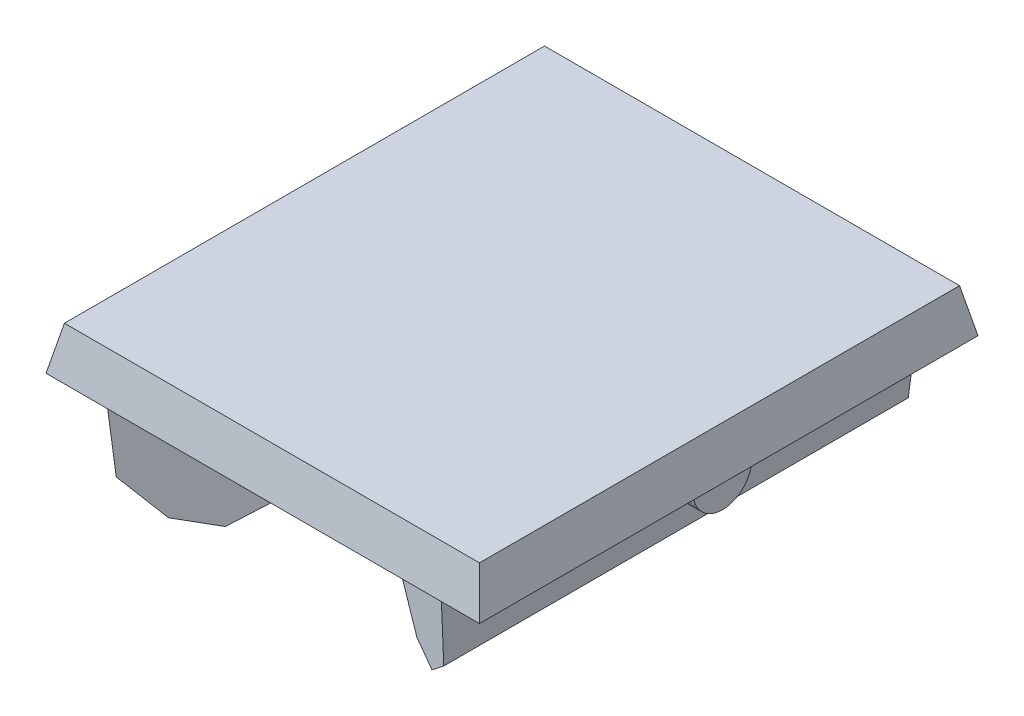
ISO-10303-21;
HEADER;
FILE_DESCRIPTION(('STEP AP214'),'2;1');
FILE_NAME('part.step','',(''),(''),'','','');
FILE_SCHEMA(('AUTOMOTIVE_DESIGN { 1 0 10303 214 1 1 1 1 }'));
ENDSEC;
DATA;
#1=APPLICATION_CONTEXT('core data for automotive mechanical design processes');
#2=APPLICATION_PROTOCOL_DEFINITION('international standard','automotive_design',2000,#1);
#3=PRODUCT_CONTEXT('',#1,'mechanical');
#4=PRODUCT('Part','Part','',(#3));
#5=PRODUCT_RELATED_PRODUCT_CATEGORY('part','',(#4));
#6=PRODUCT_DEFINITION_FORMATION('','',#4);
#7=PRODUCT_DEFINITION_CONTEXT('part definition',#1,'design');
#8=PRODUCT_DEFINITION('design','',#6,#7);
#9=PRODUCT_DEFINITION_SHAPE('','',#8);
#10=(LENGTH_UNIT() NAMED_UNIT(*) SI_UNIT(.MILLI.,.METRE.));
#11=(NAMED_UNIT(*) PLANE_ANGLE_UNIT() SI_UNIT($,.RADIAN.));
#12=(NAMED_UNIT(*) SI_UNIT($,.STERADIAN.) SOLID_ANGLE_UNIT());
#13=UNCERTAINTY_MEASURE_WITH_UNIT(LENGTH_MEASURE(1.E-05),#10,'distance_accuracy_value','');
#14=(GEOMETRIC_REPRESENTATION_CONTEXT(3) GLOBAL_UNCERTAINTY_ASSIGNED_CONTEXT((#13)) GLOBAL_UNIT_ASSIGNED_CONTEXT((#10,
#11,#12)) REPRESENTATION_CONTEXT('',''));
#15=CARTESIAN_POINT('',(0.,0.,0.));
#16=DIRECTION('',(0.,0.,1.));
#17=DIRECTION('',(1.,0.,0.));
#18=AXIS2_PLACEMENT_3D('',#15,#16,#17);
#19=CARTESIAN_POINT('',(-24.8812672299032,-1.30397196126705,110.1));
#20=DIRECTION('',(-0.998629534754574,-0.0523359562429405,0.));
#21=DIRECTION('',(0.0523359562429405,-0.998629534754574,0.));
#22=AXIS2_PLACEMENT_3D('',#19,#20,#21);
#23=PLANE('',#22);
#24=CARTESIAN_POINT('',(-24.7839905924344,-3.16012077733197,0.0591410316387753));
#25=DIRECTION('',(-0.998629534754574,-0.0523359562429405,0.));
#26=DIRECTION('',(-0.0523359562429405,0.998629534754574,0.));
#27=AXIS2_PLACEMENT_3D('',#24,#25,#26);
#28=ELLIPSE('',#27,13.5029463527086,13.4844410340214);
#29=CARTESIAN_POINT('',(-24.7839905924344,-3.16012077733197,-13.4253000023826));
#30=VERTEX_POINT('',#29);
#31=CARTESIAN_POINT('',(-24.7839905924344,-3.16012077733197,13.5435820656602));
#32=VERTEX_POINT('',#31);
#33=EDGE_CURVE('E12',#30,#32,#28,.T.);
#34=ORIENTED_EDGE('',*,*,#33,.F.);
#35=DIRECTION('',(0.,0.,-1.));
#36=VECTOR('',#35,1.);
#37=CARTESIAN_POINT('',(-24.7839905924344,-3.16012077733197,110.1));
#38=LINE('',#37,#36);
#39=CARTESIAN_POINT('',(-24.7839905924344,-3.16012077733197,-110.1));
#40=VERTEX_POINT('',#39);
#41=EDGE_CURVE('E323',#30,#40,#38,.T.);
#42=ORIENTED_EDGE('',*,*,#41,.T.);
#43=DIRECTION('',(-0.0523359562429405,0.998629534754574,0.));
#44=VECTOR('',#43,1.);
#45=CARTESIAN_POINT('',(-24.8812672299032,-1.30397196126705,-110.1));
#46=LINE('',#45,#44);
#47=CARTESIAN_POINT('',(-24.7088643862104,-4.59361418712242,-110.1));
#48=VERTEX_POINT('',#47);
#49=EDGE_CURVE('E324',#48,#40,#46,.T.);
#50=ORIENTED_EDGE('',*,*,#49,.F.);
#51=DIRECTION('',(0.0521220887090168,-0.994548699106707,0.0903115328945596));
#52=VECTOR('',#51,1.);
#53=CARTESIAN_POINT('',(-23.843329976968,-21.1089945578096,-108.600295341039));
#54=LINE('',#53,#52);
#55=CARTESIAN_POINT('',(-23.0440352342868,-36.3604467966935,-107.21536363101));
#56=VERTEX_POINT('',#55);
#57=EDGE_CURVE('E314',#56,#48,#54,.F.);
#58=ORIENTED_EDGE('',*,*,#57,.F.);
#59=DIRECTION('',(0.,0.,-1.));
#60=VECTOR('',#59,1.);
#61=CARTESIAN_POINT('',(-23.0440352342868,-36.3604467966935,110.1));
#62=LINE('',#61,#60);
#63=CARTESIAN_POINT('',(-23.0440352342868,-36.3604467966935,107.093597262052));
#64=VERTEX_POINT('',#63);
#65=EDGE_CURVE('E344',#64,#56,#62,.T.);
#66=ORIENTED_EDGE('',*,*,#65,.F.);
#67=DIRECTION('',(-0.0521220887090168,0.994548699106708,0.0903115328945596));
#68=VECTOR('',#67,1.);
#69=CARTESIAN_POINT('',(-24.8804342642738,-1.3198658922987,110.275511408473));
#70=LINE('',#69,#68);
#71=CARTESIAN_POINT('',(-24.779140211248,-3.25267156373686,110.1));
#72=VERTEX_POINT('',#71);
#73=EDGE_CURVE('E357',#72,#64,#70,.F.);
#74=ORIENTED_EDGE('',*,*,#73,.F.);
#75=DIRECTION('',(-0.0523359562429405,0.998629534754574,0.));
#76=VECTOR('',#75,1.);
#77=CARTESIAN_POINT('',(-24.8812672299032,-1.30397196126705,110.1));
#78=LINE('',#77,#76);
#79=CARTESIAN_POINT('',(-24.7839905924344,-3.16012077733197,110.1));
#80=VERTEX_POINT('',#79);
#81=EDGE_CURVE('E317',#72,#80,#78,.T.);
#82=ORIENTED_EDGE('',*,*,#81,.T.);
#83=EDGE_CURVE('E330',#80,#32,#38,.T.);
#84=ORIENTED_EDGE('',*,*,#83,.T.);
#85=EDGE_LOOP('',(#34,#42,#50,#58,#66,#74,#82,#84));
#86=FACE_BOUND('',#85,.T.);
#87=ADVANCED_FACE('F57',(#86),#23,.T.);
#88=CARTESIAN_POINT('',(-28.7238682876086,-31.1175239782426,110.1));
#89=DIRECTION('',(-0.678280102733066,-0.734803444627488,0.));
#90=DIRECTION('',(0.734803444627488,-0.678280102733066,0.));
#91=AXIS2_PLACEMENT_3D('',#88,#89,#90);
#92=PLANE('',#91);
#93=DIRECTION('',(-0.66613673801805,0.6148954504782,0.422096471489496));
#94=VECTOR('',#93,1.);
#95=CARTESIAN_POINT('',(-28.5572405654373,-31.2713341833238,110.58703094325));
#96=LINE('',#95,#94);
#97=CARTESIAN_POINT('',(-8.31918008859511,-49.952620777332,97.7632165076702));
#98=VERTEX_POINT('',#97);
#99=EDGE_CURVE('E355',#64,#98,#96,.F.);
#100=ORIENTED_EDGE('',*,*,#99,.F.);
#101=ORIENTED_EDGE('',*,*,#65,.T.);
#102=DIRECTION('',(0.66613673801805,-0.6148954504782,0.422096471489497));
#103=VECTOR('',#102,1.);
#104=CARTESIAN_POINT('',(33.3915044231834,-88.4547910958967,-71.4550747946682));
#105=LINE('',#104,#103);
#106=CARTESIAN_POINT('',(-8.31918008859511,-49.952620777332,-97.8849828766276));
#107=VERTEX_POINT('',#106);
#108=EDGE_CURVE('E371',#107,#56,#105,.F.);
#109=ORIENTED_EDGE('',*,*,#108,.F.);
#110=DIRECTION('',(0.,0.,-1.));
#111=VECTOR('',#110,1.);
#112=CARTESIAN_POINT('',(-8.31918008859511,-49.952620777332,110.1));
#113=LINE('',#112,#111);
#114=EDGE_CURVE('E341',#98,#107,#113,.T.);
#115=ORIENTED_EDGE('',*,*,#114,.F.);
#116=EDGE_LOOP('',(#100,#101,#109,#115));
#117=FACE_BOUND('',#116,.T.);
#118=ADVANCED_FACE('F407',(#117),#92,.T.);
#119=CARTESIAN_POINT('',(0.,-49.952620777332,110.1));
#120=DIRECTION('',(0.,-1.,0.));
#121=DIRECTION('',(0.,0.,-1.));
#122=AXIS2_PLACEMENT_3D('',#119,#120,#121);
#123=PLANE('',#122);
#124=DIRECTION('',(-0.86586507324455,0.,0.500277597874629));
#125=VECTOR('',#124,1.);
#126=CARTESIAN_POINT('',(-7.4260653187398,-49.952620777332,97.2471946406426));
#127=LINE('',#126,#125);
#128=CARTESIAN_POINT('',(8.31918008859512,-49.952620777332,88.1499417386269));
#129=VERTEX_POINT('',#128);
#130=EDGE_CURVE('E353',#98,#129,#127,.F.);
#131=ORIENTED_EDGE('',*,*,#130,.F.);
#132=ORIENTED_EDGE('',*,*,#114,.T.);
#133=DIRECTION('',(0.86586507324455,0.,0.50027759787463));
#134=VECTOR('',#133,1.);
#135=CARTESIAN_POINT('',(88.0113529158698,-49.952620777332,-42.227341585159));
#136=LINE('',#135,#134);
#137=CARTESIAN_POINT('',(8.31918008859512,-49.952620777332,-88.2717081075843));
#138=VERTEX_POINT('',#137);
#139=EDGE_CURVE('E365',#138,#107,#136,.F.);
#140=ORIENTED_EDGE('',*,*,#139,.F.);
#141=DIRECTION('',(0.,0.,-1.));
#142=VECTOR('',#141,1.);
#143=CARTESIAN_POINT('',(8.31918008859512,-49.952620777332,110.1));
#144=LINE('',#143,#142);
#145=EDGE_CURVE('E338',#129,#138,#144,.T.);
#146=ORIENTED_EDGE('',*,*,#145,.F.);
#147=EDGE_LOOP('',(#131,#132,#140,#146));
#148=FACE_BOUND('',#147,.T.);
#149=ADVANCED_FACE('F412',(#148),#123,.T.);
#150=CARTESIAN_POINT('',(28.7238682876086,-31.1175239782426,110.1));
#151=DIRECTION('',(-0.678280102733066,0.734803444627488,0.));
#152=DIRECTION('',(-0.734803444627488,-0.678280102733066,0.));
#153=AXIS2_PLACEMENT_3D('',#150,#151,#152);
#154=PLANE('',#153);
#155=DIRECTION('',(0.,0.,-1.));
#156=VECTOR('',#155,1.);
#157=CARTESIAN_POINT('',(23.0440352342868,-36.3604467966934,110.1));
#158=LINE('',#157,#156);
#159=CARTESIAN_POINT('',(23.0440352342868,-36.3604467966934,80.4649343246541));
#160=VERTEX_POINT('',#159);
#161=CARTESIAN_POINT('',(23.0440352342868,-36.3604467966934,-80.5867006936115));
#162=VERTEX_POINT('',#161);
#163=EDGE_CURVE('E335',#160,#162,#158,.T.);
#164=ORIENTED_EDGE('',*,*,#163,.F.);
#165=DIRECTION('',(0.686081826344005,0.633306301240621,-0.358071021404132));
#166=VECTOR('',#165,1.);
#167=CARTESIAN_POINT('',(20.7153006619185,-38.510047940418,81.680317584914));
#168=LINE('',#167,#166);
#169=EDGE_CURVE('E350',#160,#129,#168,.F.);
#170=ORIENTED_EDGE('',*,*,#169,.T.);
#171=ORIENTED_EDGE('',*,*,#145,.T.);
#172=DIRECTION('',(-0.686081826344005,-0.633306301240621,-0.358071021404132));
#173=VECTOR('',#172,1.);
#174=CARTESIAN_POINT('',(74.8408721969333,11.4520180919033,-53.5535603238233));
#175=LINE('',#174,#173);
#176=EDGE_CURVE('E362',#138,#162,#175,.F.);
#177=ORIENTED_EDGE('',*,*,#176,.T.);
#178=EDGE_LOOP('',(#164,#170,#171,#177));
#179=FACE_BOUND('',#178,.T.);
#180=ADVANCED_FACE('F439',(#179),#154,.F.);
#181=CARTESIAN_POINT('',(24.8812672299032,-1.30397196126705,110.1));
#182=DIRECTION('',(-0.998629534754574,0.0523359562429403,0.));
#183=DIRECTION('',(-0.0523359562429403,-0.998629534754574,0.));
#184=AXIS2_PLACEMENT_3D('',#181,#182,#183);
#185=PLANE('',#184);
#186=DIRECTION('',(0.,0.,-1.));
#187=VECTOR('',#186,1.);
#188=CARTESIAN_POINT('',(24.7839905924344,-3.16012077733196,110.1));
#189=LINE('',#188,#187);
#190=CARTESIAN_POINT('',(24.7839905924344,-3.16012077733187,-14.0427951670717));
#191=VERTEX_POINT('',#190);
#192=CARTESIAN_POINT('',(24.7839905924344,-3.16012077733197,-81.5908925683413));
#193=VERTEX_POINT('',#192);
#194=EDGE_CURVE('E332',#191,#193,#189,.T.);
#195=ORIENTED_EDGE('',*,*,#194,.F.);
#196=CARTESIAN_POINT('',(24.7839905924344,-3.16012077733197,0.0591410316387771));
#197=DIRECTION('',(-0.998629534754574,0.0523359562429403,0.));
#198=DIRECTION('',(-0.0523359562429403,-0.998629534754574,0.));
#199=AXIS2_PLACEMENT_3D('',#196,#197,#198);
#200=ELLIPSE('',#199,14.1212889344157,14.1019361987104);
#201=CARTESIAN_POINT('',(24.7839905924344,-3.16012077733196,14.1610772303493));
#202=VERTEX_POINT('',#201);
#203=EDGE_CURVE('E65',#191,#202,#200,.T.);
#204=ORIENTED_EDGE('',*,*,#203,.T.);
#205=CARTESIAN_POINT('',(24.7839905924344,-3.16012077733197,81.4691261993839));
#206=VERTEX_POINT('',#205);
#207=EDGE_CURVE('E333',#206,#202,#189,.T.);
#208=ORIENTED_EDGE('',*,*,#207,.F.);
#209=DIRECTION('',(0.0523120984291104,0.998174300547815,0.0301912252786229));
#210=VECTOR('',#209,1.);
#211=CARTESIAN_POINT('',(24.9263971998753,-0.442840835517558,81.5513142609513));
#212=LINE('',#211,#210);
#213=EDGE_CURVE('E327',#206,#160,#212,.F.);
#214=ORIENTED_EDGE('',*,*,#213,.T.);
#215=ORIENTED_EDGE('',*,*,#163,.T.);
#216=DIRECTION('',(-0.0523120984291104,-0.998174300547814,0.0301912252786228));
#217=VECTOR('',#216,1.);
#218=CARTESIAN_POINT('',(24.5784284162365,-7.08248075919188,-81.4722551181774));
#219=LINE('',#218,#217);
#220=EDGE_CURVE('E359',#162,#193,#219,.F.);
#221=ORIENTED_EDGE('',*,*,#220,.T.);
#222=EDGE_LOOP('',(#195,#204,#208,#214,#215,#221));
#223=FACE_BOUND('',#222,.T.);
#224=ADVANCED_FACE('F376',(#223),#185,.F.);
#225=CARTESIAN_POINT('',(0.,-3.16012077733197,110.1));
#226=DIRECTION('',(0.,1.,0.));
#227=DIRECTION('',(0.,0.,1.));
#228=AXIS2_PLACEMENT_3D('',#225,#226,#227);
#229=PLANE('',#228);
#230=ORIENTED_EDGE('',*,*,#207,.T.);
#231=DIRECTION('',(1.,0.,0.));
#232=VECTOR('',#231,1.);
#233=CARTESIAN_POINT('',(23.635525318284,-3.16012077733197,14.1610772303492));
#234=LINE('',#233,#232);
#235=CARTESIAN_POINT('',(80.2160094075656,-3.16012077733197,14.1610772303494));
#236=VERTEX_POINT('',#235);
#237=EDGE_CURVE('E78',#202,#236,#234,.T.);
#238=ORIENTED_EDGE('',*,*,#237,.T.);
#239=DIRECTION('',(0.,0.,-1.));
#240=VECTOR('',#239,1.);
#241=CARTESIAN_POINT('',(80.2160094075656,-3.16012077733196,110.1));
#242=LINE('',#241,#240);
#243=CARTESIAN_POINT('',(80.2160094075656,-3.16012077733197,81.4691261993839));
#244=VERTEX_POINT('',#243);
#245=EDGE_CURVE('E245',#244,#236,#242,.T.);
#246=ORIENTED_EDGE('',*,*,#245,.F.);
#247=DIRECTION('',(0.86586507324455,0.,0.500277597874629));
#248=VECTOR('',#247,1.);
#249=CARTESIAN_POINT('',(136.166791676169,-3.16012077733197,113.796244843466));
#250=LINE('',#249,#248);
#251=CARTESIAN_POINT('',(129.769444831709,-3.16012077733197,110.1));
#252=VERTEX_POINT('',#251);
#253=EDGE_CURVE('E225',#244,#252,#250,.T.);
#254=ORIENTED_EDGE('',*,*,#253,.T.);
#255=DIRECTION('',(-1.,0.,0.));
#256=VECTOR('',#255,1.);
#257=CARTESIAN_POINT('',(105.,-3.16012077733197,110.1));
#258=LINE('',#257,#256);
#259=CARTESIAN_POINT('',(129.783990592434,-3.16012077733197,110.1));
#260=VERTEX_POINT('',#259);
#261=EDGE_CURVE('E235',#260,#252,#258,.T.);
#262=ORIENTED_EDGE('',*,*,#261,.F.);
#263=DIRECTION('',(0.,0.,-1.));
#264=VECTOR('',#263,1.);
#265=CARTESIAN_POINT('',(129.783990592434,-3.16012077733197,110.1));
#266=LINE('',#265,#264);
#267=CARTESIAN_POINT('',(129.783990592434,-3.16012077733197,13.5435820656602));
#268=VERTEX_POINT('',#267);
#269=EDGE_CURVE('E241',#260,#268,#266,.T.);
#270=ORIENTED_EDGE('',*,*,#269,.T.);
#271=DIRECTION('',(-1.,0.,0.));
#272=VECTOR('',#271,1.);
#273=CARTESIAN_POINT('',(129.628570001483,-3.16012077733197,13.5435820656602));
#274=LINE('',#273,#272);
#275=CARTESIAN_POINT('',(149.628570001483,-3.16012077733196,13.5435820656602));
#276=VERTEX_POINT('',#275);
#277=EDGE_CURVE('E289',#276,#268,#274,.T.);
#278=ORIENTED_EDGE('',*,*,#277,.F.);
#279=DIRECTION('',(0.,0.,1.));
#280=VECTOR('',#279,1.);
#281=CARTESIAN_POINT('',(149.628570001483,-3.16012077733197,-13.4253000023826));
#282=LINE('',#281,#280);
#283=CARTESIAN_POINT('',(149.628570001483,-3.16012077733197,-13.4253000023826));
#284=VERTEX_POINT('',#283);
#285=EDGE_CURVE('E286',#284,#276,#282,.T.);
#286=ORIENTED_EDGE('',*,*,#285,.F.);
#287=DIRECTION('',(-1.,0.,0.));
#288=VECTOR('',#287,1.);
#289=CARTESIAN_POINT('',(129.628570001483,-3.16012077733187,-13.4253000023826));
#290=LINE('',#289,#288);
#291=CARTESIAN_POINT('',(129.783990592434,-3.16012077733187,-13.4253000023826));
#292=VERTEX_POINT('',#291);
#293=EDGE_CURVE('E291',#284,#292,#290,.T.);
#294=ORIENTED_EDGE('',*,*,#293,.T.);
#295=CARTESIAN_POINT('',(129.783990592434,-3.16012077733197,-110.1));
#296=VERTEX_POINT('',#295);
#297=EDGE_CURVE('E231',#292,#296,#266,.T.);
#298=ORIENTED_EDGE('',*,*,#297,.T.);
#299=DIRECTION('',(-1.,0.,0.));
#300=VECTOR('',#299,1.);
#301=CARTESIAN_POINT('',(105.,-3.16012077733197,-110.1));
#302=LINE('',#301,#300);
#303=CARTESIAN_POINT('',(129.558695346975,-3.16012077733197,-110.1));
#304=VERTEX_POINT('',#303);
#305=EDGE_CURVE('E208',#296,#304,#302,.T.);
#306=ORIENTED_EDGE('',*,*,#305,.T.);
#307=DIRECTION('',(-0.86586507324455,0.,0.50027759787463));
#308=VECTOR('',#307,1.);
#309=CARTESIAN_POINT('',(135.958082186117,-3.16012077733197,-113.79742350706));
#310=LINE('',#309,#308);
#311=CARTESIAN_POINT('',(80.2160094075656,-3.16012077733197,-81.5908925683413));
#312=VERTEX_POINT('',#311);
#313=EDGE_CURVE('E219',#304,#312,#310,.T.);
#314=ORIENTED_EDGE('',*,*,#313,.T.);
#315=CARTESIAN_POINT('',(80.2160094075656,-3.16012077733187,-14.0427951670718));
#316=VERTEX_POINT('',#315);
#317=EDGE_CURVE('E244',#316,#312,#242,.T.);
#318=ORIENTED_EDGE('',*,*,#317,.F.);
#319=DIRECTION('',(1.,0.,0.));
#320=VECTOR('',#319,1.);
#321=CARTESIAN_POINT('',(23.635525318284,-3.16012077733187,-14.0427951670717));
#322=LINE('',#321,#320);
#323=EDGE_CURVE('E299',#191,#316,#322,.T.);
#324=ORIENTED_EDGE('',*,*,#323,.F.);
#325=ORIENTED_EDGE('',*,*,#194,.T.);
#326=DIRECTION('',(0.86586507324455,0.,0.50027759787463));
#327=VECTOR('',#326,1.);
#328=CARTESIAN_POINT('',(-30.9580821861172,-3.16012077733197,-113.79742350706));
#329=LINE('',#328,#327);
#330=CARTESIAN_POINT('',(-24.5586953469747,-3.16012077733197,-110.1));
#331=VERTEX_POINT('',#330);
#332=EDGE_CURVE('E311',#331,#193,#329,.T.);
#333=ORIENTED_EDGE('',*,*,#332,.F.);
#334=DIRECTION('',(1.,0.,0.));
#335=VECTOR('',#334,1.);
#336=CARTESIAN_POINT('',(0.,-3.16012077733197,-110.1));
#337=LINE('',#336,#335);
#338=EDGE_CURVE('E320',#40,#331,#337,.T.);
#339=ORIENTED_EDGE('',*,*,#338,.F.);
#340=ORIENTED_EDGE('',*,*,#41,.F.);
#341=DIRECTION('',(1.,0.,0.));
#342=VECTOR('',#341,1.);
#343=CARTESIAN_POINT('',(-24.6285700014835,-3.16012077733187,-13.4253000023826));
#344=LINE('',#343,#342);
#345=CARTESIAN_POINT('',(-44.6285700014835,-3.16012077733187,-13.4253000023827));
#346=VERTEX_POINT('',#345);
#347=EDGE_CURVE('E301',#346,#30,#344,.T.);
#348=ORIENTED_EDGE('',*,*,#347,.F.);
#349=DIRECTION('',(0.,0.,-1.));
#350=VECTOR('',#349,1.);
#351=CARTESIAN_POINT('',(-44.6285700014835,-3.16012077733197,0.059141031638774));
#352=LINE('',#351,#350);
#353=CARTESIAN_POINT('',(-44.6285700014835,-3.16012077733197,13.5435820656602));
#354=VERTEX_POINT('',#353);
#355=EDGE_CURVE('E296',#354,#346,#352,.T.);
#356=ORIENTED_EDGE('',*,*,#355,.F.);
#357=DIRECTION('',(1.,0.,0.));
#358=VECTOR('',#357,1.);
#359=CARTESIAN_POINT('',(-24.6285700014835,-3.16012077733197,13.5435820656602));
#360=LINE('',#359,#358);
#361=EDGE_CURVE('E295',#354,#32,#360,.T.);
#362=ORIENTED_EDGE('',*,*,#361,.T.);
#363=ORIENTED_EDGE('',*,*,#83,.F.);
#364=DIRECTION('',(1.,0.,0.));
#365=VECTOR('',#364,1.);
#366=CARTESIAN_POINT('',(0.,-3.16012077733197,110.1));
#367=LINE('',#366,#365);
#368=CARTESIAN_POINT('',(-24.7694448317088,-3.16012077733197,110.1));
#369=VERTEX_POINT('',#368);
#370=EDGE_CURVE('E319',#80,#369,#367,.T.);
#371=ORIENTED_EDGE('',*,*,#370,.T.);
#372=DIRECTION('',(-0.86586507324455,0.,0.500277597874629));
#373=VECTOR('',#372,1.);
#374=CARTESIAN_POINT('',(-31.1667916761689,-3.16012077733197,113.796244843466));
#375=LINE('',#374,#373);
#376=EDGE_CURVE('E312',#206,#369,#375,.T.);
#377=ORIENTED_EDGE('',*,*,#376,.F.);
#378=EDGE_LOOP('',(#230,#238,#246,#254,#262,#270,#278,#286,#294,#298,#306,#314,#318,#324,#325,
#333,#339,#340,#348,#356,#362,#363,#371,#377));
#379=FACE_BOUND('',#378,.T.);
#380=ADVANCED_FACE('F228',(#379),#229,.T.);
#381=CARTESIAN_POINT('',(0.,0.,110.1));
#382=DIRECTION('',(0.,0.,1.));
#383=DIRECTION('',(1.,0.,0.));
#384=AXIS2_PLACEMENT_3D('',#381,#382,#383);
#385=PLANE('',#384);
#386=DIRECTION('',(0.104187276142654,0.994557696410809,0.));
#387=VECTOR('',#386,1.);
#388=CARTESIAN_POINT('',(-24.1731202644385,2.53231317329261,110.1));
#389=LINE('',#388,#387);
#390=EDGE_CURVE('E360',#369,#72,#389,.F.);
#391=ORIENTED_EDGE('',*,*,#390,.F.);
#392=ORIENTED_EDGE('',*,*,#370,.F.);
#393=ORIENTED_EDGE('',*,*,#81,.F.);
#394=EDGE_LOOP('',(#391,#392,#393));
#395=FACE_BOUND('',#394,.T.);
#396=ADVANCED_FACE('F388',(#395),#385,.T.);
#397=CARTESIAN_POINT('',(0.,0.,-110.1));
#398=DIRECTION('',(0.,0.,1.));
#399=DIRECTION('',(1.,0.,0.));
#400=AXIS2_PLACEMENT_3D('',#397,#398,#399);
#401=PLANE('',#400);
#402=ORIENTED_EDGE('',*,*,#338,.T.);
#403=DIRECTION('',(0.104187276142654,0.994557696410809,0.));
#404=VECTOR('',#403,1.);
#405=CARTESIAN_POINT('',(-23.9646584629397,2.51047525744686,-110.1));
#406=LINE('',#405,#404);
#407=EDGE_CURVE('E347',#331,#48,#406,.F.);
#408=ORIENTED_EDGE('',*,*,#407,.T.);
#409=ORIENTED_EDGE('',*,*,#49,.T.);
#410=EDGE_LOOP('',(#402,#408,#409));
#411=FACE_BOUND('',#410,.T.);
#412=ADVANCED_FACE('F424',(#411),#401,.F.);
#413=CARTESIAN_POINT('',(-30.9580821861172,-3.16012077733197,-113.79742350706));
#414=DIRECTION('',(0.499591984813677,-0.0523359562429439,-0.86467843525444));
#415=DIRECTION('',(-0.86586507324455,0.,-0.50027759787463));
#416=AXIS2_PLACEMENT_3D('',#413,#414,#415);
#417=PLANE('',#416);
#418=ORIENTED_EDGE('',*,*,#176,.F.);
#419=ORIENTED_EDGE('',*,*,#139,.T.);
#420=ORIENTED_EDGE('',*,*,#108,.T.);
#421=ORIENTED_EDGE('',*,*,#57,.T.);
#422=ORIENTED_EDGE('',*,*,#407,.F.);
#423=ORIENTED_EDGE('',*,*,#332,.T.);
#424=ORIENTED_EDGE('',*,*,#220,.F.);
#425=EDGE_LOOP('',(#418,#419,#420,#421,#422,#423,#424));
#426=FACE_BOUND('',#425,.T.);
#427=ADVANCED_FACE('F59',(#426),#417,.T.);
#428=CARTESIAN_POINT('',(-31.1667916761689,-3.16012077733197,113.796244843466));
#429=DIRECTION('',(0.499591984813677,-0.0523359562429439,0.86467843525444));
#430=DIRECTION('',(0.86586507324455,0.,-0.500277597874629));
#431=AXIS2_PLACEMENT_3D('',#428,#429,#430);
#432=PLANE('',#431);
#433=ORIENTED_EDGE('',*,*,#376,.T.);
#434=ORIENTED_EDGE('',*,*,#390,.T.);
#435=ORIENTED_EDGE('',*,*,#73,.T.);
#436=ORIENTED_EDGE('',*,*,#99,.T.);
#437=ORIENTED_EDGE('',*,*,#130,.T.);
#438=ORIENTED_EDGE('',*,*,#169,.F.);
#439=ORIENTED_EDGE('',*,*,#213,.F.);
#440=EDGE_LOOP('',(#433,#434,#435,#436,#437,#438,#439));
#441=FACE_BOUND('',#440,.T.);
#442=ADVANCED_FACE('F384',(#441),#432,.T.);
#443=CARTESIAN_POINT('',(136.166791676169,-3.16012077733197,113.796244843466));
#444=DIRECTION('',(-0.499591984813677,-0.0523359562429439,0.86467843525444));
#445=DIRECTION('',(-0.86586507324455,0.,-0.500277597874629));
#446=AXIS2_PLACEMENT_3D('',#443,#444,#445);
#447=PLANE('',#446);
#448=ORIENTED_EDGE('',*,*,#253,.F.);
#449=DIRECTION('',(-0.0523120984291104,0.998174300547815,0.0301912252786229));
#450=VECTOR('',#449,1.);
#451=CARTESIAN_POINT('',(80.0736028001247,-0.442840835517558,81.5513142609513));
#452=LINE('',#451,#450);
#453=CARTESIAN_POINT('',(81.9559647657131,-36.3604467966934,80.4649343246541));
#454=VERTEX_POINT('',#453);
#455=EDGE_CURVE('E237',#244,#454,#452,.F.);
#456=ORIENTED_EDGE('',*,*,#455,.T.);
#457=DIRECTION('',(-0.686081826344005,0.633306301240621,-0.358071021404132));
#458=VECTOR('',#457,1.);
#459=CARTESIAN_POINT('',(84.2846993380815,-38.510047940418,81.680317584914));
#460=LINE('',#459,#458);
#461=CARTESIAN_POINT('',(96.6808199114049,-49.952620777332,88.1499417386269));
#462=VERTEX_POINT('',#461);
#463=EDGE_CURVE('E260',#454,#462,#460,.F.);
#464=ORIENTED_EDGE('',*,*,#463,.T.);
#465=DIRECTION('',(0.86586507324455,0.,0.500277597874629));
#466=VECTOR('',#465,1.);
#467=CARTESIAN_POINT('',(112.42606531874,-49.952620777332,97.2471946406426));
#468=LINE('',#467,#466);
#469=CARTESIAN_POINT('',(113.319180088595,-49.952620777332,97.7632165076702));
#470=VERTEX_POINT('',#469);
#471=EDGE_CURVE('E262',#470,#462,#468,.F.);
#472=ORIENTED_EDGE('',*,*,#471,.F.);
#473=DIRECTION('',(0.66613673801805,0.6148954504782,0.422096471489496));
#474=VECTOR('',#473,1.);
#475=CARTESIAN_POINT('',(133.557240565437,-31.2713341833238,110.58703094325));
#476=LINE('',#475,#474);
#477=CARTESIAN_POINT('',(128.044035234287,-36.3604467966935,107.093597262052));
#478=VERTEX_POINT('',#477);
#479=EDGE_CURVE('E265',#478,#470,#476,.F.);
#480=ORIENTED_EDGE('',*,*,#479,.F.);
#481=DIRECTION('',(0.0521220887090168,0.994548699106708,0.0903115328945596));
#482=VECTOR('',#481,1.);
#483=CARTESIAN_POINT('',(129.880434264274,-1.3198658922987,110.275511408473));
#484=LINE('',#483,#482);
#485=CARTESIAN_POINT('',(129.779140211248,-3.25267156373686,110.1));
#486=VERTEX_POINT('',#485);
#487=EDGE_CURVE('E268',#486,#478,#484,.F.);
#488=ORIENTED_EDGE('',*,*,#487,.F.);
#489=DIRECTION('',(-0.104187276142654,0.994557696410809,0.));
#490=VECTOR('',#489,1.);
#491=CARTESIAN_POINT('',(129.173120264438,2.53231317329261,110.1));
#492=LINE('',#491,#490);
#493=EDGE_CURVE('E214',#252,#486,#492,.F.);
#494=ORIENTED_EDGE('',*,*,#493,.F.);
#495=EDGE_LOOP('',(#448,#456,#464,#472,#480,#488,#494));
#496=FACE_BOUND('',#495,.T.);
#497=ADVANCED_FACE('F417',(#496),#447,.T.);
#498=CARTESIAN_POINT('',(135.958082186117,-3.16012077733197,-113.79742350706));
#499=DIRECTION('',(-0.499591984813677,-0.0523359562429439,-0.86467843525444));
#500=DIRECTION('',(0.86586507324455,0.,-0.50027759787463));
#501=AXIS2_PLACEMENT_3D('',#498,#499,#500);
#502=PLANE('',#501);
#503=DIRECTION('',(0.686081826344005,-0.633306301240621,-0.358071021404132));
#504=VECTOR('',#503,1.);
#505=CARTESIAN_POINT('',(30.1591278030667,11.4520180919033,-53.5535603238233));
#506=LINE('',#505,#504);
#507=CARTESIAN_POINT('',(96.6808199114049,-49.952620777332,-88.2717081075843));
#508=VERTEX_POINT('',#507);
#509=CARTESIAN_POINT('',(81.9559647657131,-36.3604467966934,-80.5867006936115));
#510=VERTEX_POINT('',#509);
#511=EDGE_CURVE('E273',#508,#510,#506,.F.);
#512=ORIENTED_EDGE('',*,*,#511,.T.);
#513=DIRECTION('',(0.0523120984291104,-0.998174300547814,0.0301912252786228));
#514=VECTOR('',#513,1.);
#515=CARTESIAN_POINT('',(80.4215715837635,-7.08248075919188,-81.4722551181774));
#516=LINE('',#515,#514);
#517=EDGE_CURVE('E222',#510,#312,#516,.F.);
#518=ORIENTED_EDGE('',*,*,#517,.T.);
#519=ORIENTED_EDGE('',*,*,#313,.F.);
#520=DIRECTION('',(-0.104187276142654,0.994557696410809,0.));
#521=VECTOR('',#520,1.);
#522=CARTESIAN_POINT('',(128.96465846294,2.51047525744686,-110.1));
#523=LINE('',#522,#521);
#524=CARTESIAN_POINT('',(129.70886438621,-4.59361418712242,-110.1));
#525=VERTEX_POINT('',#524);
#526=EDGE_CURVE('E204',#304,#525,#523,.F.);
#527=ORIENTED_EDGE('',*,*,#526,.T.);
#528=DIRECTION('',(-0.0521220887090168,-0.994548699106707,0.0903115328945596));
#529=VECTOR('',#528,1.);
#530=CARTESIAN_POINT('',(128.843329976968,-21.1089945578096,-108.600295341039));
#531=LINE('',#530,#529);
#532=CARTESIAN_POINT('',(128.044035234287,-36.3604467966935,-107.21536363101));
#533=VERTEX_POINT('',#532);
#534=EDGE_CURVE('E277',#533,#525,#531,.F.);
#535=ORIENTED_EDGE('',*,*,#534,.F.);
#536=DIRECTION('',(-0.66613673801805,-0.6148954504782,0.422096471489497));
#537=VECTOR('',#536,1.);
#538=CARTESIAN_POINT('',(71.6084955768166,-88.4547910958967,-71.4550747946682));
#539=LINE('',#538,#537);
#540=CARTESIAN_POINT('',(113.319180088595,-49.952620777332,-97.8849828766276));
#541=VERTEX_POINT('',#540);
#542=EDGE_CURVE('E279',#541,#533,#539,.F.);
#543=ORIENTED_EDGE('',*,*,#542,.F.);
#544=DIRECTION('',(-0.86586507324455,0.,0.50027759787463));
#545=VECTOR('',#544,1.);
#546=CARTESIAN_POINT('',(16.9886470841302,-49.952620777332,-42.227341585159));
#547=LINE('',#546,#545);
#548=EDGE_CURVE('E275',#508,#541,#547,.F.);
#549=ORIENTED_EDGE('',*,*,#548,.F.);
#550=EDGE_LOOP('',(#512,#518,#519,#527,#535,#543,#549));
#551=FACE_BOUND('',#550,.T.);
#552=ADVANCED_FACE('F221',(#551),#502,.T.);
#553=CARTESIAN_POINT('',(105.,0.,-110.1));
#554=DIRECTION('',(0.,0.,1.));
#555=DIRECTION('',(-1.,0.,0.));
#556=AXIS2_PLACEMENT_3D('',#553,#554,#555);
#557=PLANE('',#556);
#558=ORIENTED_EDGE('',*,*,#305,.F.);
#559=DIRECTION('',(0.0523359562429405,0.998629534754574,0.));
#560=VECTOR('',#559,1.);
#561=CARTESIAN_POINT('',(129.881267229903,-1.30397196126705,-110.1));
#562=LINE('',#561,#560);
#563=EDGE_CURVE('E210',#525,#296,#562,.T.);
#564=ORIENTED_EDGE('',*,*,#563,.F.);
#565=ORIENTED_EDGE('',*,*,#526,.F.);
#566=EDGE_LOOP('',(#558,#564,#565));
#567=FACE_BOUND('',#566,.T.);
#568=ADVANCED_FACE('F206',(#567),#557,.F.);
#569=CARTESIAN_POINT('',(105.,0.,110.1));
#570=DIRECTION('',(0.,0.,1.));
#571=DIRECTION('',(-1.,0.,0.));
#572=AXIS2_PLACEMENT_3D('',#569,#570,#571);
#573=PLANE('',#572);
#574=ORIENTED_EDGE('',*,*,#493,.T.);
#575=DIRECTION('',(0.0523359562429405,0.998629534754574,0.));
#576=VECTOR('',#575,1.);
#577=CARTESIAN_POINT('',(129.881267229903,-1.30397196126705,110.1));
#578=LINE('',#577,#576);
#579=EDGE_CURVE('E232',#486,#260,#578,.T.);
#580=ORIENTED_EDGE('',*,*,#579,.T.);
#581=ORIENTED_EDGE('',*,*,#261,.T.);
#582=EDGE_LOOP('',(#574,#580,#581));
#583=FACE_BOUND('',#582,.T.);
#584=ADVANCED_FACE('F453',(#583),#573,.T.);
#585=CARTESIAN_POINT('',(80.1187327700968,-1.30397196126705,110.1));
#586=DIRECTION('',(0.998629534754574,0.0523359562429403,0.));
#587=DIRECTION('',(0.0523359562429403,-0.998629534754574,0.));
#588=AXIS2_PLACEMENT_3D('',#585,#586,#587);
#589=PLANE('',#588);
#590=CARTESIAN_POINT('',(80.2160094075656,-3.16012077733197,0.059141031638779));
#591=DIRECTION('',(0.998629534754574,0.0523359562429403,0.));
#592=DIRECTION('',(-0.0523359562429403,0.998629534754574,0.));
#593=AXIS2_PLACEMENT_3D('',#590,#591,#592);
#594=ELLIPSE('',#593,14.1212889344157,14.1019361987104);
#595=EDGE_CURVE('E272',#316,#236,#594,.F.);
#596=ORIENTED_EDGE('',*,*,#595,.F.);
#597=ORIENTED_EDGE('',*,*,#317,.T.);
#598=ORIENTED_EDGE('',*,*,#517,.F.);
#599=DIRECTION('',(0.,0.,-1.));
#600=VECTOR('',#599,1.);
#601=CARTESIAN_POINT('',(81.9559647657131,-36.3604467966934,110.1));
#602=LINE('',#601,#600);
#603=EDGE_CURVE('E248',#454,#510,#602,.T.);
#604=ORIENTED_EDGE('',*,*,#603,.F.);
#605=ORIENTED_EDGE('',*,*,#455,.F.);
#606=ORIENTED_EDGE('',*,*,#245,.T.);
#607=EDGE_LOOP('',(#596,#597,#598,#604,#605,#606));
#608=FACE_BOUND('',#607,.T.);
#609=ADVANCED_FACE('F446',(#608),#589,.F.);
#610=CARTESIAN_POINT('',(76.2761317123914,-31.1175239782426,110.1));
#611=DIRECTION('',(0.678280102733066,0.734803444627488,0.));
#612=DIRECTION('',(0.734803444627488,-0.678280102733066,0.));
#613=AXIS2_PLACEMENT_3D('',#610,#611,#612);
#614=PLANE('',#613);
#615=ORIENTED_EDGE('',*,*,#603,.T.);
#616=ORIENTED_EDGE('',*,*,#511,.F.);
#617=DIRECTION('',(0.,0.,-1.));
#618=VECTOR('',#617,1.);
#619=CARTESIAN_POINT('',(96.6808199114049,-49.952620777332,110.1));
#620=LINE('',#619,#618);
#621=EDGE_CURVE('E251',#462,#508,#620,.T.);
#622=ORIENTED_EDGE('',*,*,#621,.F.);
#623=ORIENTED_EDGE('',*,*,#463,.F.);
#624=EDGE_LOOP('',(#615,#616,#622,#623));
#625=FACE_BOUND('',#624,.T.);
#626=ADVANCED_FACE('F476',(#625),#614,.F.);
#627=CARTESIAN_POINT('',(105.,-49.952620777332,110.1));
#628=DIRECTION('',(0.,-1.,0.));
#629=DIRECTION('',(0.,0.,-1.));
#630=AXIS2_PLACEMENT_3D('',#627,#628,#629);
#631=PLANE('',#630);
#632=ORIENTED_EDGE('',*,*,#471,.T.);
#633=ORIENTED_EDGE('',*,*,#621,.T.);
#634=ORIENTED_EDGE('',*,*,#548,.T.);
#635=DIRECTION('',(0.,0.,-1.));
#636=VECTOR('',#635,1.);
#637=CARTESIAN_POINT('',(113.319180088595,-49.952620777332,110.1));
#638=LINE('',#637,#636);
#639=EDGE_CURVE('E254',#470,#541,#638,.T.);
#640=ORIENTED_EDGE('',*,*,#639,.F.);
#641=EDGE_LOOP('',(#632,#633,#634,#640));
#642=FACE_BOUND('',#641,.T.);
#643=ADVANCED_FACE('F472',(#642),#631,.T.);
#644=CARTESIAN_POINT('',(133.723868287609,-31.1175239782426,110.1));
#645=DIRECTION('',(0.678280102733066,-0.734803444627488,0.));
#646=DIRECTION('',(-0.734803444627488,-0.678280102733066,0.));
#647=AXIS2_PLACEMENT_3D('',#644,#645,#646);
#648=PLANE('',#647);
#649=ORIENTED_EDGE('',*,*,#479,.T.);
#650=ORIENTED_EDGE('',*,*,#639,.T.);
#651=ORIENTED_EDGE('',*,*,#542,.T.);
#652=DIRECTION('',(0.,0.,-1.));
#653=VECTOR('',#652,1.);
#654=CARTESIAN_POINT('',(128.044035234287,-36.3604467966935,110.1));
#655=LINE('',#654,#653);
#656=EDGE_CURVE('E215',#478,#533,#655,.T.);
#657=ORIENTED_EDGE('',*,*,#656,.F.);
#658=EDGE_LOOP('',(#649,#650,#651,#657));
#659=FACE_BOUND('',#658,.T.);
#660=ADVANCED_FACE('F470',(#659),#648,.T.);
#661=CARTESIAN_POINT('',(129.881267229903,-1.30397196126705,110.1));
#662=DIRECTION('',(0.998629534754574,-0.0523359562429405,0.));
#663=DIRECTION('',(-0.0523359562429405,-0.998629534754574,0.));
#664=AXIS2_PLACEMENT_3D('',#661,#662,#663);
#665=PLANE('',#664);
#666=ORIENTED_EDGE('',*,*,#297,.F.);
#667=CARTESIAN_POINT('',(129.783990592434,-3.16012077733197,0.0591410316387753));
#668=DIRECTION('',(0.998629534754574,-0.0523359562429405,0.));
#669=DIRECTION('',(0.0523359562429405,0.998629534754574,0.));
#670=AXIS2_PLACEMENT_3D('',#667,#668,#669);
#671=ELLIPSE('',#670,13.5029463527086,13.4844410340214);
#672=EDGE_CURVE('E304',#292,#268,#671,.F.);
#673=ORIENTED_EDGE('',*,*,#672,.T.);
#674=ORIENTED_EDGE('',*,*,#269,.F.);
#675=ORIENTED_EDGE('',*,*,#579,.F.);
#676=ORIENTED_EDGE('',*,*,#487,.T.);
#677=ORIENTED_EDGE('',*,*,#656,.T.);
#678=ORIENTED_EDGE('',*,*,#534,.T.);
#679=ORIENTED_EDGE('',*,*,#563,.T.);
#680=EDGE_LOOP('',(#666,#673,#674,#675,#676,#677,#678,#679));
#681=FACE_BOUND('',#680,.T.);
#682=ADVANCED_FACE('F458',(#681),#665,.T.);
#683=CARTESIAN_POINT('',(149.628570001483,-3.16012077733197,0.0591410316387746));
#684=DIRECTION('',(1.,0.,0.));
#685=DIRECTION('',(0.,0.,-1.));
#686=AXIS2_PLACEMENT_3D('',#683,#684,#685);
#687=PLANE('',#686);
#688=CARTESIAN_POINT('',(149.628570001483,-3.16012077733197,0.0591410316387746));
#689=DIRECTION('',(1.,0.,0.));
#690=DIRECTION('',(0.,0.,-1.));
#691=AXIS2_PLACEMENT_3D('',#688,#689,#690);
#692=CIRCLE('',#691,13.4844410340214);
#693=EDGE_CURVE('E283',#276,#284,#692,.T.);
#694=ORIENTED_EDGE('',*,*,#693,.T.);
#695=ORIENTED_EDGE('',*,*,#285,.T.);
#696=EDGE_LOOP('',(#694,#695));
#697=FACE_BOUND('',#696,.T.);
#698=ADVANCED_FACE('F463',(#697),#687,.T.);
#699=CARTESIAN_POINT('',(80.0835700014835,-3.16012077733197,0.0591410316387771));
#700=DIRECTION('',(1.,0.,0.));
#701=DIRECTION('',(0.,0.,1.));
#702=AXIS2_PLACEMENT_3D('',#699,#700,#701);
#703=CYLINDRICAL_SURFACE('',#702,13.4844410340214);
#704=ORIENTED_EDGE('',*,*,#672,.F.);
#705=ORIENTED_EDGE('',*,*,#293,.F.);
#706=ORIENTED_EDGE('',*,*,#693,.F.);
#707=ORIENTED_EDGE('',*,*,#277,.T.);
#708=EDGE_LOOP('',(#704,#705,#706,#707));
#709=FACE_BOUND('',#708,.T.);
#710=ADVANCED_FACE('F464',(#709),#703,.T.);
#711=CARTESIAN_POINT('',(24.9164299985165,-3.16012077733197,0.0591410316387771));
#712=DIRECTION('',(-1.,0.,0.));
#713=DIRECTION('',(0.,0.,1.));
#714=AXIS2_PLACEMENT_3D('',#711,#712,#713);
#715=CYLINDRICAL_SURFACE('',#714,14.1019361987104);
#716=ORIENTED_EDGE('',*,*,#203,.F.);
#717=ORIENTED_EDGE('',*,*,#323,.T.);
#718=ORIENTED_EDGE('',*,*,#595,.T.);
#719=ORIENTED_EDGE('',*,*,#237,.F.);
#720=EDGE_LOOP('',(#716,#717,#718,#719));
#721=FACE_BOUND('',#720,.T.);
#722=ADVANCED_FACE('F402',(#721),#715,.T.);
#723=CARTESIAN_POINT('',(24.9164299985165,-3.16012077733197,0.0591410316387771));
#724=DIRECTION('',(-1.,0.,0.));
#725=DIRECTION('',(0.,0.,1.));
#726=AXIS2_PLACEMENT_3D('',#723,#724,#725);
#727=CYLINDRICAL_SURFACE('',#726,13.4844410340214);
#728=ORIENTED_EDGE('',*,*,#347,.T.);
#729=ORIENTED_EDGE('',*,*,#33,.T.);
#730=ORIENTED_EDGE('',*,*,#361,.F.);
#731=CARTESIAN_POINT('',(-44.6285700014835,-3.16012077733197,0.0591410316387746));
#732=DIRECTION('',(-0.994521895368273,-0.104528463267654,0.));
#733=DIRECTION('',(-0.104528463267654,0.994521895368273,0.));
#734=AXIS2_PLACEMENT_3D('',#731,#732,#733);
#735=ELLIPSE('',#734,13.5587171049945,13.4844410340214);
#736=EDGE_CURVE('E293',#346,#354,#735,.T.);
#737=ORIENTED_EDGE('',*,*,#736,.F.);
#738=EDGE_LOOP('',(#728,#729,#730,#737));
#739=FACE_BOUND('',#738,.T.);
#740=ADVANCED_FACE('F393',(#739),#727,.T.);
#741=CARTESIAN_POINT('',(-44.6285700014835,-3.16012077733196,0.));
#742=DIRECTION('',(-0.994521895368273,-0.104528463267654,0.));
#743=DIRECTION('',(0.104528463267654,-0.994521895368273,0.));
#744=AXIS2_PLACEMENT_3D('',#741,#742,#743);
#745=PLANE('',#744);
#746=ORIENTED_EDGE('',*,*,#736,.T.);
#747=ORIENTED_EDGE('',*,*,#355,.T.);
#748=EDGE_LOOP('',(#746,#747));
#749=FACE_BOUND('',#748,.T.);
#750=ADVANCED_FACE('F396',(#749),#745,.T.);
#751=CLOSED_SHELL('',(#87,#118,#149,#180,#224,#380,#396,#412,#427,#442,#497,#552,#568,#584,#609,
#626,#643,#660,#682,#698,#710,#722,#740,#750));
#752=MANIFOLD_SOLID_BREP('B2',#751);
#753=CARTESIAN_POINT('',(-47.5,-3.16012077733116,-114.940858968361));
#754=DIRECTION('',(0.,0.207911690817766,-0.978147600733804));
#755=DIRECTION('',(0.,0.978147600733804,0.207911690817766));
#756=AXIS2_PLACEMENT_3D('',#753,#754,#755);
#757=PLANE('',#756);
#758=DIRECTION('',(1.,0.,0.));
#759=VECTOR('',#758,1.);
#760=CARTESIAN_POINT('',(-47.5,-3.16012077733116,-114.940858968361));
#761=LINE('',#760,#759);
#762=CARTESIAN_POINT('',(-47.5,-3.16012077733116,-114.940858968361));
#763=VERTEX_POINT('',#762);
#764=CARTESIAN_POINT('',(152.5,-3.16012077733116,-114.940858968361));
#765=VERTEX_POINT('',#764);
#766=EDGE_CURVE('E785',#763,#765,#761,.T.);
#767=ORIENTED_EDGE('',*,*,#766,.F.);
#768=DIRECTION('',(-0.203558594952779,-0.957667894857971,-0.203558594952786));
#769=VECTOR('',#768,1.);
#770=CARTESIAN_POINT('',(-37.9696966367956,41.6764313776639,-105.410555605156));
#771=LINE('',#770,#769);
#772=CARTESIAN_POINT('',(-43.2488687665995,16.8398792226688,-110.689727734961));
#773=VERTEX_POINT('',#772);
#774=EDGE_CURVE('E55',#773,#763,#771,.T.);
#775=ORIENTED_EDGE('',*,*,#774,.F.);
#776=DIRECTION('',(1.,0.,0.));
#777=VECTOR('',#776,1.);
#778=CARTESIAN_POINT('',(-47.5,16.8398792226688,-110.689727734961));
#779=LINE('',#778,#777);
#780=CARTESIAN_POINT('',(148.2488687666,16.8398792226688,-110.689727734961));
#781=VERTEX_POINT('',#780);
#782=EDGE_CURVE('E787',#773,#781,#779,.T.);
#783=ORIENTED_EDGE('',*,*,#782,.T.);
#784=DIRECTION('',(-0.203558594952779,0.957667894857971,0.203558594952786));
#785=VECTOR('',#784,1.);
#786=CARTESIAN_POINT('',(142.969696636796,41.6764313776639,-105.410555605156));
#787=LINE('',#786,#785);
#788=EDGE_CURVE('E782',#781,#765,#787,.F.);
#789=ORIENTED_EDGE('',*,*,#788,.T.);
#790=EDGE_LOOP('',(#767,#775,#783,#789));
#791=FACE_BOUND('',#790,.T.);
#792=ADVANCED_FACE('F734',(#791),#757,.T.);
#793=CARTESIAN_POINT('',(-47.5,-3.16012077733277,115.059141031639));
#794=DIRECTION('',(-0.978147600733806,0.207911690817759,0.));
#795=DIRECTION('',(-0.207911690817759,-0.978147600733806,0.));
#796=AXIS2_PLACEMENT_3D('',#793,#794,#795);
#797=PLANE('',#796);
#798=DIRECTION('',(0.,0.,-1.));
#799=VECTOR('',#798,1.);
#800=CARTESIAN_POINT('',(-47.5,-3.16012077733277,115.059141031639));
#801=LINE('',#800,#799);
#802=CARTESIAN_POINT('',(-47.5,-3.16012077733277,115.059141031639));
#803=VERTEX_POINT('',#802);
#804=EDGE_CURVE('E802',#803,#763,#801,.T.);
#805=ORIENTED_EDGE('',*,*,#804,.F.);
#806=DIRECTION('',(0.203558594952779,0.957667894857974,-0.203558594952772));
#807=VECTOR('',#806,1.);
#808=CARTESIAN_POINT('',(-47.5,-3.16012077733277,115.059141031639));
#809=LINE('',#808,#807);
#810=CARTESIAN_POINT('',(-43.2488687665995,16.8398792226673,110.808009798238));
#811=VERTEX_POINT('',#810);
#812=EDGE_CURVE('E745',#811,#803,#809,.F.);
#813=ORIENTED_EDGE('',*,*,#812,.F.);
#814=DIRECTION('',(0.,0.,-1.));
#815=VECTOR('',#814,1.);
#816=CARTESIAN_POINT('',(-43.2488687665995,16.8398792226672,115.059141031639));
#817=LINE('',#816,#815);
#818=EDGE_CURVE('E791',#811,#773,#817,.T.);
#819=ORIENTED_EDGE('',*,*,#818,.T.);
#820=ORIENTED_EDGE('',*,*,#774,.T.);
#821=EDGE_LOOP('',(#805,#813,#819,#820));
#822=FACE_BOUND('',#821,.T.);
#823=ADVANCED_FACE('F736',(#822),#797,.T.);
#824=CARTESIAN_POINT('',(-47.5,-3.16012077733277,115.059141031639));
#825=DIRECTION('',(0.,0.207911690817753,0.978147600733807));
#826=DIRECTION('',(0.,-0.978147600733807,0.207911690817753));
#827=AXIS2_PLACEMENT_3D('',#824,#825,#826);
#828=PLANE('',#827);
#829=DIRECTION('',(1.,0.,0.));
#830=VECTOR('',#829,1.);
#831=CARTESIAN_POINT('',(-47.5,-3.16012077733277,115.059141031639));
#832=LINE('',#831,#830);
#833=CARTESIAN_POINT('',(152.5,-3.16012077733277,115.059141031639));
#834=VERTEX_POINT('',#833);
#835=EDGE_CURVE('E799',#803,#834,#832,.T.);
#836=ORIENTED_EDGE('',*,*,#835,.T.);
#837=DIRECTION('',(0.203558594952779,-0.957667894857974,0.203558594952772));
#838=VECTOR('',#837,1.);
#839=CARTESIAN_POINT('',(152.5,-3.16012077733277,115.059141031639));
#840=LINE('',#839,#838);
#841=CARTESIAN_POINT('',(148.2488687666,16.8398792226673,110.808009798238));
#842=VERTEX_POINT('',#841);
#843=EDGE_CURVE('E790',#842,#834,#840,.T.);
#844=ORIENTED_EDGE('',*,*,#843,.F.);
#845=DIRECTION('',(-1.,0.,0.));
#846=VECTOR('',#845,1.);
#847=CARTESIAN_POINT('',(-47.5,16.8398792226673,110.808009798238));
#848=LINE('',#847,#846);
#849=EDGE_CURVE('E765',#811,#842,#848,.F.);
#850=ORIENTED_EDGE('',*,*,#849,.F.);
#851=ORIENTED_EDGE('',*,*,#812,.T.);
#852=EDGE_LOOP('',(#836,#844,#850,#851));
#853=FACE_BOUND('',#852,.T.);
#854=ADVANCED_FACE('F827',(#853),#828,.T.);
#855=CARTESIAN_POINT('',(152.5,-3.16012077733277,115.059141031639));
#856=DIRECTION('',(0.978147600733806,0.207911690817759,0.));
#857=DIRECTION('',(-0.207911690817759,0.978147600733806,0.));
#858=AXIS2_PLACEMENT_3D('',#855,#856,#857);
#859=PLANE('',#858);
#860=DIRECTION('',(0.,0.,-1.));
#861=VECTOR('',#860,1.);
#862=CARTESIAN_POINT('',(152.5,-3.16012077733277,115.059141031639));
#863=LINE('',#862,#861);
#864=EDGE_CURVE('E795',#834,#765,#863,.T.);
#865=ORIENTED_EDGE('',*,*,#864,.T.);
#866=ORIENTED_EDGE('',*,*,#788,.F.);
#867=DIRECTION('',(0.,0.,1.));
#868=VECTOR('',#867,1.);
#869=CARTESIAN_POINT('',(148.2488687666,16.8398792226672,115.059141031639));
#870=LINE('',#869,#868);
#871=EDGE_CURVE('E738',#842,#781,#870,.F.);
#872=ORIENTED_EDGE('',*,*,#871,.F.);
#873=ORIENTED_EDGE('',*,*,#843,.T.);
#874=EDGE_LOOP('',(#865,#866,#872,#873));
#875=FACE_BOUND('',#874,.T.);
#876=ADVANCED_FACE('F796',(#875),#859,.T.);
#877=CARTESIAN_POINT('',(0.,16.839879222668,1.17588503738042E-13));
#878=DIRECTION('',(0.,1.,0.));
#879=DIRECTION('',(0.,0.,1.));
#880=AXIS2_PLACEMENT_3D('',#877,#878,#879);
#881=PLANE('',#880);
#882=ORIENTED_EDGE('',*,*,#782,.F.);
#883=ORIENTED_EDGE('',*,*,#818,.F.);
#884=ORIENTED_EDGE('',*,*,#849,.T.);
#885=ORIENTED_EDGE('',*,*,#871,.T.);
#886=EDGE_LOOP('',(#882,#883,#884,#885));
#887=FACE_BOUND('',#886,.T.);
#888=ADVANCED_FACE('F819',(#887),#881,.T.);
#889=CARTESIAN_POINT('',(0.,-3.16012077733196,0.));
#890=DIRECTION('',(0.,1.,0.));
#891=DIRECTION('',(0.,0.,1.));
#892=AXIS2_PLACEMENT_3D('',#889,#890,#891);
#893=PLANE('',#892);
#894=ORIENTED_EDGE('',*,*,#766,.T.);
#895=ORIENTED_EDGE('',*,*,#864,.F.);
#896=ORIENTED_EDGE('',*,*,#835,.F.);
#897=ORIENTED_EDGE('',*,*,#804,.T.);
#898=EDGE_LOOP('',(#894,#895,#896,#897));
#899=FACE_BOUND('',#898,.T.);
#900=ADVANCED_FACE('F801',(#899),#893,.F.);
#901=CLOSED_SHELL('',(#792,#823,#854,#876,#888,#900));
#902=MANIFOLD_SOLID_BREP('B6',#901);
#903=ADVANCED_BREP_SHAPE_REPRESENTATION('',(#18,#752,#902),#14);
#904=SHAPE_DEFINITION_REPRESENTATION(#9,#903);
ENDSEC;
END-ISO-10303-21;
